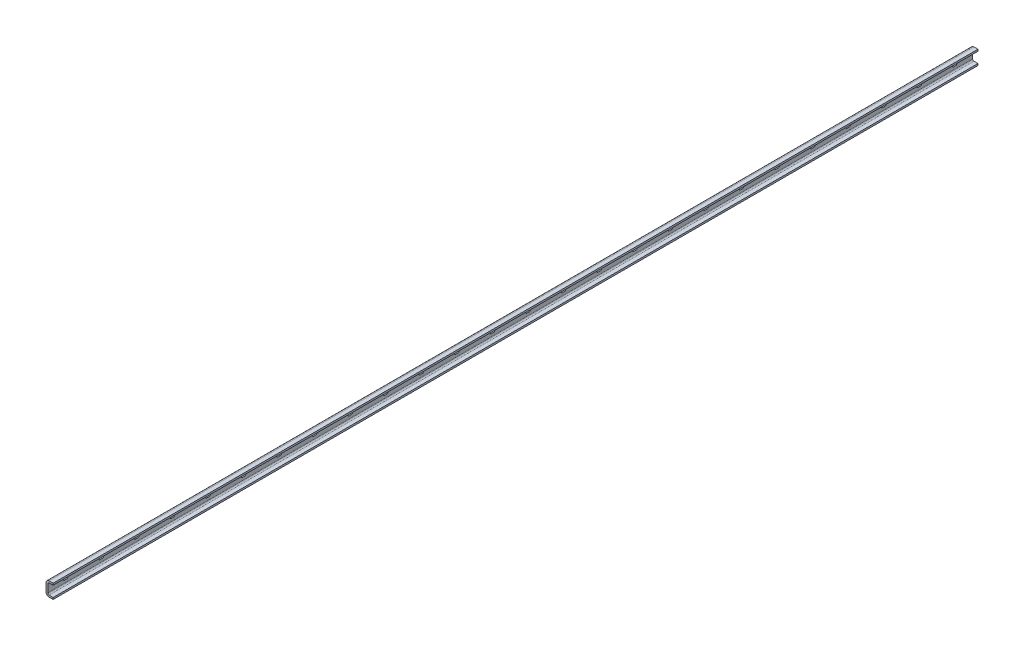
from build123d import *

# Parameters (mm, degrees)
EXTRUDE1_DEPTH  = 2080
EXTRUDE2_DEPTH  = 2081.095384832
LPATTERN1_COUNT = 26
LPATTERN1_PITCH = 80


with BuildPart() as part:
    # Sketch1 → Extrude1 (new body)
    with BuildSketch(Plane.XY):
        with BuildLine():
            Line((16, 11.9), (16, 15.9))
            Line((16, 15.9), (7, 15.9))
            ThreePointArc((7, 15.9), (2.050252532, 13.849747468), (0, 8.9))
            Line((0, 8.9), (0, -8.9))
            ThreePointArc((0, -8.9), (2.050252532, -13.849747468), (7, -15.9))
            Line((7, -15.9), (16, -15.9))
            Line((16, -15.9), (16, -11.9))
            Line((16, -11.9), (7, -11.9))
            ThreePointArc((7, -11.9), (4.878679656, -11.021320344), (4, -8.9))
            Line((4, -8.9), (4, 8.9))
            ThreePointArc((4, 8.9), (4.878679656, 11.021320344), (7, 11.9))
            Line((7, 11.9), (16, 11.9))
        make_face()
    extrude(amount=-EXTRUDE1_DEPTH)

    # Sketch2 → Extrude2 (cut, through all)
    with BuildSketch(Plane(origin=(4, 0, 0), x_dir=(0, 0, -1), z_dir=(1, 0, 0))):
        with BuildLine():
            Line((37.5, 3), (42.5, 3))
            ThreePointArc((42.5, 3), (45.5, 0), (42.5, -3))
            Line((42.5, -3), (37.5, -3))
            ThreePointArc((37.5, -3), (34.5, 0), (37.5, 3))
        make_face()
    extrude2 = extrude(amount=-EXTRUDE2_DEPTH, mode=Mode.SUBTRACT)

    # LPattern1: Extrude2 ×26
    with Locations(*[(0, 0, -i * LPATTERN1_PITCH) for i in range(1, LPATTERN1_COUNT)]):
        add(extrude2, mode=Mode.SUBTRACT)


solid = part.part
